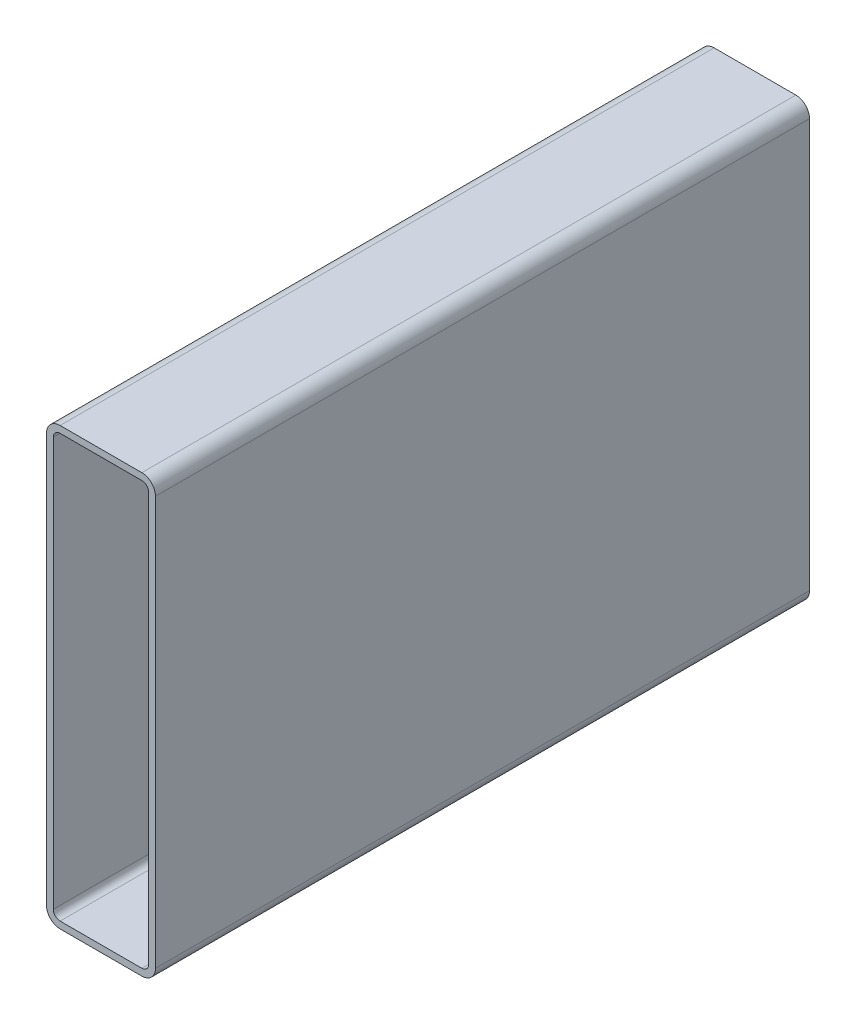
from build123d import *

# Parameters (mm, degrees)
BOSS_EXTRUDE1_DEPTH = 304.8


with BuildPart() as part:
    # Sketch1 → Boss-Extrude1 (new body)
    with BuildSketch(Plane.XY):
        with BuildLine():
            Line((6.35, 203.2), (44.45, 203.2))
            ThreePointArc((44.45, 203.2), (48.940128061, 201.340128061), (50.8, 196.85))
            Line((50.8, 196.85), (50.8, 6.35))
            ThreePointArc((50.8, 6.35), (48.940128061, 1.859871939), (44.45, 0))
            Line((44.45, 0), (6.35, 0))
            ThreePointArc((6.35, 0), (1.859871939, 1.859871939), (0, 6.35))
            Line((0, 6.35), (0, 196.85))
            ThreePointArc((0, 196.85), (1.859871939, 201.340128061), (6.35, 203.2))
        make_face()
        with BuildLine():
            Line((6.35, 200.025), (44.45, 200.025))
            ThreePointArc((44.45, 200.025), (46.69506403, 199.09506403), (47.625, 196.85))
            Line((47.625, 196.85), (47.625, 6.35))
            ThreePointArc((47.625, 6.35), (46.69506403, 4.10493597), (44.45, 3.175))
            Line((44.45, 3.175), (6.35, 3.175))
            ThreePointArc((6.35, 3.175), (4.10493597, 4.10493597), (3.175, 6.35))
            Line((3.175, 6.35), (3.175, 196.85))
            ThreePointArc((3.175, 196.85), (4.10493597, 199.09506403), (6.35, 200.025))
        make_face(mode=Mode.SUBTRACT)
    extrude(amount=BOSS_EXTRUDE1_DEPTH)


solid = part.part
